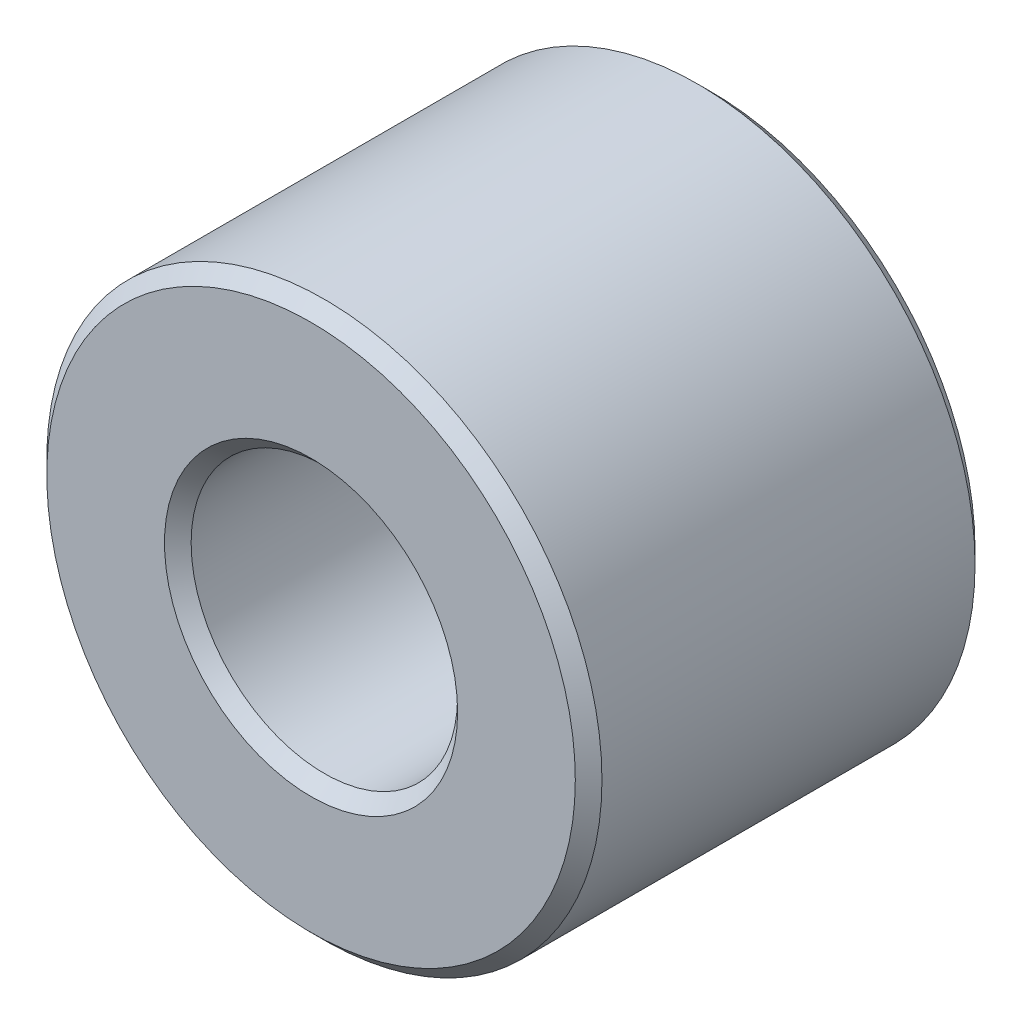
ISO-10303-21;
HEADER;
FILE_DESCRIPTION(('STEP AP214'),'2;1');
FILE_NAME('part.step','',(''),(''),'','','');
FILE_SCHEMA(('AUTOMOTIVE_DESIGN { 1 0 10303 214 1 1 1 1 }'));
ENDSEC;
DATA;
#1=APPLICATION_CONTEXT('core data for automotive mechanical design processes');
#2=APPLICATION_PROTOCOL_DEFINITION('international standard','automotive_design',2000,#1);
#3=PRODUCT_CONTEXT('',#1,'mechanical');
#4=PRODUCT('Part','Part','',(#3));
#5=PRODUCT_RELATED_PRODUCT_CATEGORY('part','',(#4));
#6=PRODUCT_DEFINITION_FORMATION('','',#4);
#7=PRODUCT_DEFINITION_CONTEXT('part definition',#1,'design');
#8=PRODUCT_DEFINITION('design','',#6,#7);
#9=PRODUCT_DEFINITION_SHAPE('','',#8);
#10=(LENGTH_UNIT() NAMED_UNIT(*) SI_UNIT(.MILLI.,.METRE.));
#11=(NAMED_UNIT(*) PLANE_ANGLE_UNIT() SI_UNIT($,.RADIAN.));
#12=(NAMED_UNIT(*) SI_UNIT($,.STERADIAN.) SOLID_ANGLE_UNIT());
#13=UNCERTAINTY_MEASURE_WITH_UNIT(LENGTH_MEASURE(1.E-05),#10,'distance_accuracy_value','');
#14=(GEOMETRIC_REPRESENTATION_CONTEXT(3) GLOBAL_UNCERTAINTY_ASSIGNED_CONTEXT((#13)) GLOBAL_UNIT_ASSIGNED_CONTEXT((#10,
#11,#12)) REPRESENTATION_CONTEXT('',''));
#15=CARTESIAN_POINT('',(0.,0.,0.));
#16=DIRECTION('',(0.,0.,1.));
#17=DIRECTION('',(1.,0.,0.));
#18=AXIS2_PLACEMENT_3D('',#15,#16,#17);
#19=CARTESIAN_POINT('',(0.,0.,27.));
#20=DIRECTION('',(0.,0.,1.));
#21=DIRECTION('',(1.,0.,0.));
#22=AXIS2_PLACEMENT_3D('',#19,#20,#21);
#23=PLANE('',#22);
#24=CARTESIAN_POINT('',(0.,0.,27.));
#25=DIRECTION('',(0.,0.,1.));
#26=DIRECTION('',(1.,0.,0.));
#27=AXIS2_PLACEMENT_3D('',#24,#25,#26);
#28=CIRCLE('',#27,19.8);
#29=CARTESIAN_POINT('',(19.8,0.,27.));
#30=VERTEX_POINT('',#29);
#31=EDGE_CURVE('E10',#30,#30,#28,.F.);
#32=ORIENTED_EDGE('',*,*,#31,.T.);
#33=EDGE_LOOP('',(#32));
#34=FACE_BOUND('',#33,.T.);
#35=CARTESIAN_POINT('',(0.,0.,27.));
#36=DIRECTION('',(0.,0.,1.));
#37=DIRECTION('',(1.,0.,0.));
#38=AXIS2_PLACEMENT_3D('',#35,#36,#37);
#39=CIRCLE('',#38,35.7);
#40=CARTESIAN_POINT('',(35.7,0.,27.));
#41=VERTEX_POINT('',#40);
#42=EDGE_CURVE('E45',#41,#41,#39,.T.);
#43=ORIENTED_EDGE('',*,*,#42,.T.);
#44=EDGE_LOOP('',(#43));
#45=FACE_BOUND('',#44,.T.);
#46=ADVANCED_FACE('F37',(#34,#45),#23,.T.);
#47=CARTESIAN_POINT('',(0.,0.,-27.));
#48=DIRECTION('',(0.,0.,1.));
#49=DIRECTION('',(1.,0.,0.));
#50=AXIS2_PLACEMENT_3D('',#47,#48,#49);
#51=PLANE('',#50);
#52=CARTESIAN_POINT('',(0.,0.,-27.));
#53=DIRECTION('',(0.,0.,1.));
#54=DIRECTION('',(1.,0.,0.));
#55=AXIS2_PLACEMENT_3D('',#52,#53,#54);
#56=CIRCLE('',#55,19.8);
#57=CARTESIAN_POINT('',(19.8,0.,-27.));
#58=VERTEX_POINT('',#57);
#59=EDGE_CURVE('E69',#58,#58,#56,.T.);
#60=ORIENTED_EDGE('',*,*,#59,.T.);
#61=EDGE_LOOP('',(#60));
#62=FACE_BOUND('',#61,.T.);
#63=CARTESIAN_POINT('',(0.,0.,-27.));
#64=DIRECTION('',(0.,0.,1.));
#65=DIRECTION('',(1.,0.,0.));
#66=AXIS2_PLACEMENT_3D('',#63,#64,#65);
#67=CIRCLE('',#66,35.7);
#68=CARTESIAN_POINT('',(35.7,0.,-27.));
#69=VERTEX_POINT('',#68);
#70=EDGE_CURVE('E73',#69,#69,#67,.F.);
#71=ORIENTED_EDGE('',*,*,#70,.T.);
#72=EDGE_LOOP('',(#71));
#73=FACE_BOUND('',#72,.T.);
#74=ADVANCED_FACE('F78',(#62,#73),#51,.F.);
#75=CARTESIAN_POINT('',(0.,0.,27.));
#76=DIRECTION('',(0.,0.,-1.));
#77=DIRECTION('',(-1.,0.,0.));
#78=AXIS2_PLACEMENT_3D('',#75,#76,#77);
#79=CYLINDRICAL_SURFACE('',#78,37.5);
#80=CARTESIAN_POINT('',(0.,0.,-25.2));
#81=DIRECTION('',(0.,0.,1.));
#82=DIRECTION('',(1.,0.,0.));
#83=AXIS2_PLACEMENT_3D('',#80,#81,#82);
#84=CIRCLE('',#83,37.5);
#85=CARTESIAN_POINT('',(37.5,0.,-25.2));
#86=VERTEX_POINT('',#85);
#87=EDGE_CURVE('E51',#86,#86,#84,.T.);
#88=ORIENTED_EDGE('',*,*,#87,.T.);
#89=EDGE_LOOP('',(#88));
#90=FACE_BOUND('',#89,.T.);
#91=CARTESIAN_POINT('',(0.,0.,25.2));
#92=DIRECTION('',(0.,0.,1.));
#93=DIRECTION('',(1.,0.,0.));
#94=AXIS2_PLACEMENT_3D('',#91,#92,#93);
#95=CIRCLE('',#94,37.5);
#96=CARTESIAN_POINT('',(37.5,0.,25.2));
#97=VERTEX_POINT('',#96);
#98=EDGE_CURVE('E57',#97,#97,#95,.F.);
#99=ORIENTED_EDGE('',*,*,#98,.T.);
#100=EDGE_LOOP('',(#99));
#101=FACE_BOUND('',#100,.T.);
#102=ADVANCED_FACE('F88',(#90,#101),#79,.T.);
#103=CARTESIAN_POINT('',(0.,0.,27.));
#104=DIRECTION('',(0.,0.,-1.));
#105=DIRECTION('',(-1.,0.,0.));
#106=AXIS2_PLACEMENT_3D('',#103,#104,#105);
#107=CYLINDRICAL_SURFACE('',#106,18.);
#108=CARTESIAN_POINT('',(0.,0.,-25.2));
#109=DIRECTION('',(0.,0.,1.));
#110=DIRECTION('',(1.,0.,0.));
#111=AXIS2_PLACEMENT_3D('',#108,#109,#110);
#112=CIRCLE('',#111,18.);
#113=CARTESIAN_POINT('',(18.,0.,-25.2));
#114=VERTEX_POINT('',#113);
#115=EDGE_CURVE('E62',#114,#114,#112,.F.);
#116=ORIENTED_EDGE('',*,*,#115,.T.);
#117=EDGE_LOOP('',(#116));
#118=FACE_BOUND('',#117,.T.);
#119=CARTESIAN_POINT('',(0.,0.,25.2));
#120=DIRECTION('',(0.,0.,1.));
#121=DIRECTION('',(1.,0.,0.));
#122=AXIS2_PLACEMENT_3D('',#119,#120,#121);
#123=CIRCLE('',#122,18.);
#124=CARTESIAN_POINT('',(18.,0.,25.2));
#125=VERTEX_POINT('',#124);
#126=EDGE_CURVE('E65',#125,#125,#123,.T.);
#127=ORIENTED_EDGE('',*,*,#126,.T.);
#128=EDGE_LOOP('',(#127));
#129=FACE_BOUND('',#128,.T.);
#130=ADVANCED_FACE('F91',(#118,#129),#107,.F.);
#131=CARTESIAN_POINT('',(0.,0.,-27.));
#132=DIRECTION('',(0.,0.,-1.));
#133=DIRECTION('',(-1.,0.,0.));
#134=AXIS2_PLACEMENT_3D('',#131,#132,#133);
#135=CONICAL_SURFACE('',#134,19.8,0.785398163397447);
#136=ORIENTED_EDGE('',*,*,#115,.F.);
#137=EDGE_LOOP('',(#136));
#138=FACE_BOUND('',#137,.T.);
#139=ORIENTED_EDGE('',*,*,#59,.F.);
#140=EDGE_LOOP('',(#139));
#141=FACE_BOUND('',#140,.T.);
#142=ADVANCED_FACE('F84',(#138,#141),#135,.F.);
#143=CARTESIAN_POINT('',(0.,0.,-25.2));
#144=DIRECTION('',(0.,0.,1.));
#145=DIRECTION('',(1.,0.,0.));
#146=AXIS2_PLACEMENT_3D('',#143,#144,#145);
#147=CONICAL_SURFACE('',#146,37.5,0.785398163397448);
#148=CARTESIAN_POINT('',(35.7,0.,-27.));
#149=CARTESIAN_POINT('',(35.71875,0.,-26.98125));
#150=CARTESIAN_POINT('',(35.7375,0.,-26.9625));
#151=CARTESIAN_POINT('',(35.775,0.,-26.925));
#152=CARTESIAN_POINT('',(35.79375,0.,-26.90625));
#153=CARTESIAN_POINT('',(35.83125,0.,-26.86875));
#154=CARTESIAN_POINT('',(35.85,0.,-26.85));
#155=CARTESIAN_POINT('',(35.8875,0.,-26.8125));
#156=CARTESIAN_POINT('',(35.90625,0.,-26.79375));
#157=CARTESIAN_POINT('',(35.94375,0.,-26.75625));
#158=CARTESIAN_POINT('',(35.9625,0.,-26.7375));
#159=CARTESIAN_POINT('',(36.,0.,-26.7));
#160=CARTESIAN_POINT('',(36.01875,0.,-26.68125));
#161=CARTESIAN_POINT('',(36.05625,0.,-26.64375));
#162=CARTESIAN_POINT('',(36.075,0.,-26.625));
#163=CARTESIAN_POINT('',(36.1125,0.,-26.5875));
#164=CARTESIAN_POINT('',(36.13125,0.,-26.56875));
#165=CARTESIAN_POINT('',(36.16875,0.,-26.53125));
#166=CARTESIAN_POINT('',(36.1875,0.,-26.5125));
#167=CARTESIAN_POINT('',(36.225,0.,-26.475));
#168=CARTESIAN_POINT('',(36.24375,0.,-26.45625));
#169=CARTESIAN_POINT('',(36.28125,0.,-26.41875));
#170=CARTESIAN_POINT('',(36.3,0.,-26.4));
#171=CARTESIAN_POINT('',(36.3375,0.,-26.3625));
#172=CARTESIAN_POINT('',(36.35625,0.,-26.34375));
#173=CARTESIAN_POINT('',(36.39375,0.,-26.30625));
#174=CARTESIAN_POINT('',(36.4125,0.,-26.2875));
#175=CARTESIAN_POINT('',(36.45,0.,-26.25));
#176=CARTESIAN_POINT('',(36.46875,0.,-26.23125));
#177=CARTESIAN_POINT('',(36.50625,0.,-26.19375));
#178=CARTESIAN_POINT('',(36.525,0.,-26.175));
#179=CARTESIAN_POINT('',(36.5625,0.,-26.1375));
#180=CARTESIAN_POINT('',(36.58125,0.,-26.11875));
#181=CARTESIAN_POINT('',(36.61875,0.,-26.08125));
#182=CARTESIAN_POINT('',(36.6375,0.,-26.0625));
#183=CARTESIAN_POINT('',(36.675,0.,-26.025));
#184=CARTESIAN_POINT('',(36.69375,0.,-26.00625));
#185=CARTESIAN_POINT('',(36.73125,0.,-25.96875));
#186=CARTESIAN_POINT('',(36.75,0.,-25.95));
#187=CARTESIAN_POINT('',(36.7875,0.,-25.9125));
#188=CARTESIAN_POINT('',(36.80625,0.,-25.89375));
#189=CARTESIAN_POINT('',(36.84375,0.,-25.85625));
#190=CARTESIAN_POINT('',(36.8625,0.,-25.8375));
#191=CARTESIAN_POINT('',(36.9,0.,-25.8));
#192=CARTESIAN_POINT('',(36.91875,0.,-25.78125));
#193=CARTESIAN_POINT('',(36.95625,0.,-25.74375));
#194=CARTESIAN_POINT('',(36.975,0.,-25.725));
#195=CARTESIAN_POINT('',(37.0125,0.,-25.6875));
#196=CARTESIAN_POINT('',(37.03125,0.,-25.66875));
#197=CARTESIAN_POINT('',(37.06875,0.,-25.63125));
#198=CARTESIAN_POINT('',(37.0875,0.,-25.6125));
#199=CARTESIAN_POINT('',(37.125,0.,-25.575));
#200=CARTESIAN_POINT('',(37.14375,0.,-25.55625));
#201=CARTESIAN_POINT('',(37.18125,0.,-25.51875));
#202=CARTESIAN_POINT('',(37.2,0.,-25.5));
#203=CARTESIAN_POINT('',(37.2375,0.,-25.4625));
#204=CARTESIAN_POINT('',(37.25625,0.,-25.44375));
#205=CARTESIAN_POINT('',(37.29375,0.,-25.40625));
#206=CARTESIAN_POINT('',(37.3125,0.,-25.3875));
#207=CARTESIAN_POINT('',(37.35,0.,-25.35));
#208=CARTESIAN_POINT('',(37.36875,0.,-25.33125));
#209=CARTESIAN_POINT('',(37.40625,0.,-25.29375));
#210=CARTESIAN_POINT('',(37.425,0.,-25.275));
#211=CARTESIAN_POINT('',(37.4625,0.,-25.2375));
#212=CARTESIAN_POINT('',(37.48125,0.,-25.21875));
#213=CARTESIAN_POINT('',(37.5,0.,-25.2));
#214=B_SPLINE_CURVE_WITH_KNOTS('',3,(#148,#149,#150,#151,#152,#153,#154,#155,#156,#157,#158,
#159,#160,#161,#162,#163,#164,#165,#166,#167,#168,#169,#170,#171,#172,#173,#174,#175,#176,#177,
#178,#179,#180,#181,#182,#183,#184,#185,#186,#187,#188,#189,#190,#191,#192,#193,#194,#195,#196,
#197,#198,#199,#200,#201,#202,#203,#204,#205,#206,#207,#208,#209,#210,#211,#212,#213),
.UNSPECIFIED.,.F.,.F.,(4,2,2,2,2,2,2,2,2,2,2,2,2,2,2,2,2,2,2,2,2,2,2,2,2,2,2,2,2,2,2,2,4),(0.,
0.0795495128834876,0.159099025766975,0.238648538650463,0.318198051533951,0.397747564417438,
0.477297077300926,0.556846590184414,0.636396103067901,0.715945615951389,0.795495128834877,
0.875044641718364,0.954594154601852,1.03414366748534,1.11369318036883,1.19324269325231,
1.2727922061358,1.35234171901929,1.43189123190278,1.51144074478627,1.59099025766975,
1.67053977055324,1.75008928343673,1.82963879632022,1.9091883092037,1.98873782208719,
2.06828733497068,2.14783684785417,2.22738636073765,2.30693587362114,2.38648538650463,
2.46603489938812,2.54558441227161),.UNSPECIFIED.);
#215=EDGE_CURVE('BSEAM80',#69,#86,#214,.T.);
#216=ORIENTED_EDGE('',*,*,#70,.F.);
#217=ORIENTED_EDGE('',*,*,#87,.F.);
#218=ORIENTED_EDGE('',*,*,#215,.T.);
#219=ORIENTED_EDGE('',*,*,#215,.F.);
#220=EDGE_LOOP('',(#216,#218,#217,#219));
#221=FACE_BOUND('',#220,.T.);
#222=ADVANCED_FACE('F80',(#221),#147,.T.);
#223=CARTESIAN_POINT('',(0.,0.,25.2));
#224=DIRECTION('',(0.,0.,1.));
#225=DIRECTION('',(1.,0.,0.));
#226=AXIS2_PLACEMENT_3D('',#223,#224,#225);
#227=CONICAL_SURFACE('',#226,18.,0.785398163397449);
#228=CARTESIAN_POINT('',(19.8,0.,27.));
#229=CARTESIAN_POINT('',(19.78125,0.,26.98125));
#230=CARTESIAN_POINT('',(19.7625,0.,26.9625));
#231=CARTESIAN_POINT('',(19.725,0.,26.925));
#232=CARTESIAN_POINT('',(19.70625,0.,26.90625));
#233=CARTESIAN_POINT('',(19.66875,0.,26.86875));
#234=CARTESIAN_POINT('',(19.65,0.,26.85));
#235=CARTESIAN_POINT('',(19.6125,0.,26.8125));
#236=CARTESIAN_POINT('',(19.59375,0.,26.79375));
#237=CARTESIAN_POINT('',(19.55625,0.,26.75625));
#238=CARTESIAN_POINT('',(19.5375,0.,26.7375));
#239=CARTESIAN_POINT('',(19.5,0.,26.7));
#240=CARTESIAN_POINT('',(19.48125,0.,26.68125));
#241=CARTESIAN_POINT('',(19.44375,0.,26.64375));
#242=CARTESIAN_POINT('',(19.425,0.,26.625));
#243=CARTESIAN_POINT('',(19.3875,0.,26.5875));
#244=CARTESIAN_POINT('',(19.36875,0.,26.56875));
#245=CARTESIAN_POINT('',(19.33125,0.,26.53125));
#246=CARTESIAN_POINT('',(19.3125,0.,26.5125));
#247=CARTESIAN_POINT('',(19.275,0.,26.475));
#248=CARTESIAN_POINT('',(19.25625,0.,26.45625));
#249=CARTESIAN_POINT('',(19.21875,0.,26.41875));
#250=CARTESIAN_POINT('',(19.2,0.,26.4));
#251=CARTESIAN_POINT('',(19.1625,0.,26.3625));
#252=CARTESIAN_POINT('',(19.14375,0.,26.34375));
#253=CARTESIAN_POINT('',(19.10625,0.,26.30625));
#254=CARTESIAN_POINT('',(19.0875,0.,26.2875));
#255=CARTESIAN_POINT('',(19.05,0.,26.25));
#256=CARTESIAN_POINT('',(19.03125,0.,26.23125));
#257=CARTESIAN_POINT('',(18.99375,0.,26.19375));
#258=CARTESIAN_POINT('',(18.975,0.,26.175));
#259=CARTESIAN_POINT('',(18.9375,0.,26.1375));
#260=CARTESIAN_POINT('',(18.91875,0.,26.11875));
#261=CARTESIAN_POINT('',(18.88125,0.,26.08125));
#262=CARTESIAN_POINT('',(18.8625,0.,26.0625));
#263=CARTESIAN_POINT('',(18.825,0.,26.025));
#264=CARTESIAN_POINT('',(18.80625,0.,26.00625));
#265=CARTESIAN_POINT('',(18.76875,0.,25.96875));
#266=CARTESIAN_POINT('',(18.75,0.,25.95));
#267=CARTESIAN_POINT('',(18.7125,0.,25.9125));
#268=CARTESIAN_POINT('',(18.69375,0.,25.89375));
#269=CARTESIAN_POINT('',(18.65625,0.,25.85625));
#270=CARTESIAN_POINT('',(18.6375,0.,25.8375));
#271=CARTESIAN_POINT('',(18.6,0.,25.8));
#272=CARTESIAN_POINT('',(18.58125,0.,25.78125));
#273=CARTESIAN_POINT('',(18.54375,0.,25.74375));
#274=CARTESIAN_POINT('',(18.525,0.,25.725));
#275=CARTESIAN_POINT('',(18.4875,0.,25.6875));
#276=CARTESIAN_POINT('',(18.46875,0.,25.66875));
#277=CARTESIAN_POINT('',(18.43125,0.,25.63125));
#278=CARTESIAN_POINT('',(18.4125,0.,25.6125));
#279=CARTESIAN_POINT('',(18.375,0.,25.575));
#280=CARTESIAN_POINT('',(18.35625,0.,25.55625));
#281=CARTESIAN_POINT('',(18.31875,0.,25.51875));
#282=CARTESIAN_POINT('',(18.3,0.,25.5));
#283=CARTESIAN_POINT('',(18.2625,0.,25.4625));
#284=CARTESIAN_POINT('',(18.24375,0.,25.44375));
#285=CARTESIAN_POINT('',(18.20625,0.,25.40625));
#286=CARTESIAN_POINT('',(18.1875,0.,25.3875));
#287=CARTESIAN_POINT('',(18.15,0.,25.35));
#288=CARTESIAN_POINT('',(18.13125,0.,25.33125));
#289=CARTESIAN_POINT('',(18.09375,0.,25.29375));
#290=CARTESIAN_POINT('',(18.075,0.,25.275));
#291=CARTESIAN_POINT('',(18.0375,0.,25.2375));
#292=CARTESIAN_POINT('',(18.01875,0.,25.21875));
#293=CARTESIAN_POINT('',(18.,0.,25.2));
#294=B_SPLINE_CURVE_WITH_KNOTS('',3,(#228,#229,#230,#231,#232,#233,#234,#235,#236,#237,#238,
#239,#240,#241,#242,#243,#244,#245,#246,#247,#248,#249,#250,#251,#252,#253,#254,#255,#256,#257,
#258,#259,#260,#261,#262,#263,#264,#265,#266,#267,#268,#269,#270,#271,#272,#273,#274,#275,#276,
#277,#278,#279,#280,#281,#282,#283,#284,#285,#286,#287,#288,#289,#290,#291,#292,#293),
.UNSPECIFIED.,.F.,.F.,(4,2,2,2,2,2,2,2,2,2,2,2,2,2,2,2,2,2,2,2,2,2,2,2,2,2,2,2,2,2,2,2,4),(0.,
0.0795495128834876,0.159099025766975,0.238648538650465,0.318198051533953,0.397747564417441,
0.477297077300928,0.556846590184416,0.636396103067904,0.715945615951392,0.795495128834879,
0.875044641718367,0.954594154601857,1.03414366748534,1.11369318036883,1.19324269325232,
1.2727922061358,1.35234171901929,1.43189123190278,1.51144074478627,1.59099025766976,
1.67053977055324,1.75008928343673,1.82963879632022,1.90918830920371,1.9887378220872,
2.06828733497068,2.14783684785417,2.22738636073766,2.30693587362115,2.38648538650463,
2.46603489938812,2.54558441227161),.UNSPECIFIED.);
#295=EDGE_CURVE('BSEAM83',#30,#125,#294,.T.);
#296=ORIENTED_EDGE('',*,*,#31,.F.);
#297=ORIENTED_EDGE('',*,*,#126,.F.);
#298=ORIENTED_EDGE('',*,*,#295,.T.);
#299=ORIENTED_EDGE('',*,*,#295,.F.);
#300=EDGE_LOOP('',(#296,#298,#297,#299));
#301=FACE_BOUND('',#300,.T.);
#302=ADVANCED_FACE('F83',(#301),#227,.F.);
#303=CARTESIAN_POINT('',(0.,0.,27.));
#304=DIRECTION('',(0.,0.,-1.));
#305=DIRECTION('',(-1.,0.,0.));
#306=AXIS2_PLACEMENT_3D('',#303,#304,#305);
#307=CONICAL_SURFACE('',#306,35.7,0.78539816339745);
#308=ORIENTED_EDGE('',*,*,#98,.F.);
#309=EDGE_LOOP('',(#308));
#310=FACE_BOUND('',#309,.T.);
#311=ORIENTED_EDGE('',*,*,#42,.F.);
#312=EDGE_LOOP('',(#311));
#313=FACE_BOUND('',#312,.T.);
#314=ADVANCED_FACE('F39',(#310,#313),#307,.T.);
#315=CLOSED_SHELL('',(#46,#74,#102,#130,#142,#222,#302,#314));
#316=MANIFOLD_SOLID_BREP('B2',#315);
#317=ADVANCED_BREP_SHAPE_REPRESENTATION('',(#18,#316),#14);
#318=SHAPE_DEFINITION_REPRESENTATION(#9,#317);
ENDSEC;
END-ISO-10303-21;
